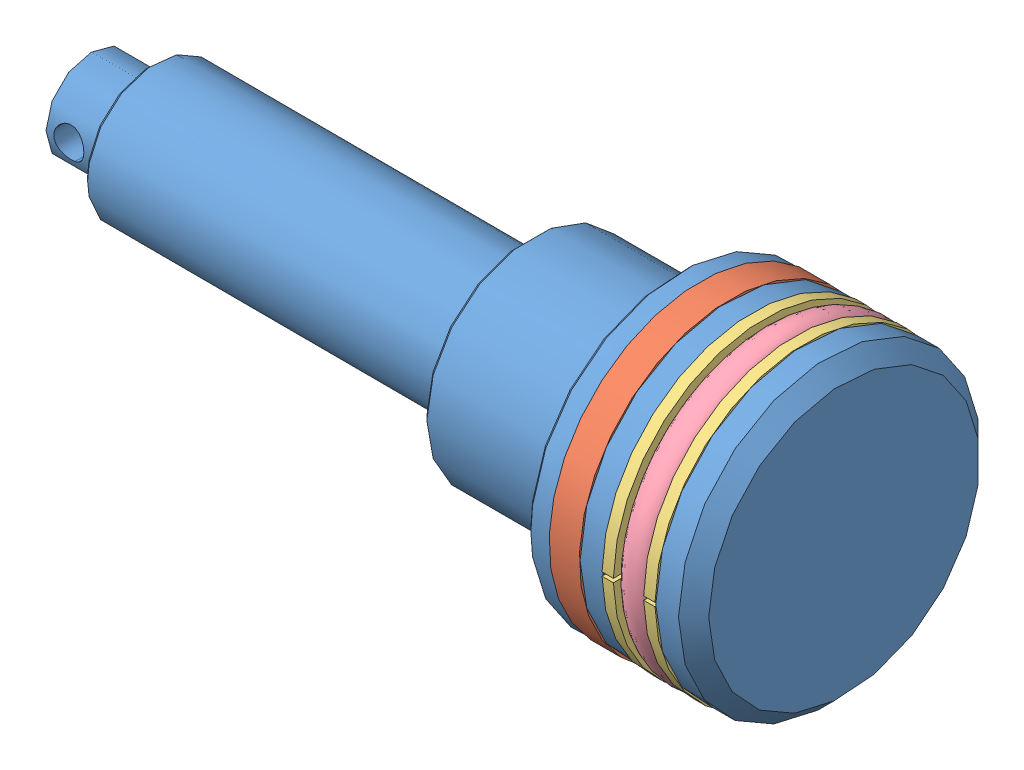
SolidWorks assembly piston.SLDASM, configuration Défaut (file format 4400). Lengths in mm.
Overall size (102 40 40).
12 component instances, 8 part files, 13 mates.
Components (placement in the parent):
- piston-1: piston.SLDPRT [Default] at origin size (102 39.8 39.8)
- racleur 40-1: racleur 40.SLDPRT [Default] at (-19 0 0) x (1 0 0) z (0 -1 0) size (4 40 40)
- bague anti-extrusion 34-40-1: bague anti-extrusion 34-40.SLDPRT [Default] at (-12 0 0) x (0 1 0) z (1 0 0) size (40 40 1.5)
- bague anti-extrusion 34-40-2: bague anti-extrusion 34-40.SLDPRT [Default] at (-5 0 0) x (0 -1 0) z (-1 0 0) size (40 40 1.5)
- joint torique 35.6x3.6-1: joint torique 35.6x3.6.SLDPRT [Default] at (-8.5 0 0) size (4 40 40)
- piston amovible-3: piston amovible.SLDASM [ecorche] at (-59.66 0 0) x (1 0 0) z (0 0.016464 -0.999864) size (18 40 40) (hidden)
  - piston amovible-1: piston amovible.SLDPRT [Default] at origin size (18 39.8 39.8)
  - joint torique 35.6x3.6-1: joint torique 35.6x3.6.SLDPRT [Default] at (13 0 0) size (4 40 40)
  - bague anti-extrusion 34-40-1: bague anti-extrusion 34-40.SLDPRT [Default] at (9.5 0 0) x (0 0 -1) z (1 0 0) size (40 40 1.5)
  - joint torique 16.9x2.7-1: joint torique 16.9x2.7.SLDPRT [Default] at (13.5 0 0) size (3 22 22)
  - bague anti-extrusion 18-21-1: bague anti-extrusion 18-21.SLDPRT [Default] at (10.5 0 0) x (0 0 -1) z (1 0 0) size (22 22 1.5)
  - racleur 18-1: racleur 18.SLDPRT [Default] at (4 0 0) size (4 21 21)
Mates (geometry in assembly coordinates):
- Coïncidente1: coincident aligned: axis of piston-1 through (0 0 0) axis (1 0 0); axis of racleur 40-1 through (-19 0 0) axis (1 0 0)
- Coïncidente2: coincident anti-aligned: plane of piston-1 through (-15 19.9 0) normal (-1 0 0); plane of racleur 40-1 through (-15 0 18.5) normal (1 0 0)
- Angle1: planar angle = 1.570796 rad aligned: plane of racleur 40-1; plane of assembly
- Coïncidente4: coincident anti-aligned: axis of piston-1 through (0 0 0) axis (1 0 0); axis of bague anti-extrusion 34-40-1 through (-10.5 0 0) axis (-1 0 0)
- Coïncidente5: coincident anti-aligned: plane of piston-1 through (-12 17 0) normal (1 0 0); plane of bague anti-extrusion 34-40-1 through (-12 0 0) normal (-1 0 0)
- Angle2: planar angle aligned: plane of bague anti-extrusion 34-40-1; plane of assembly
- Coïncidente9: coincident aligned: axis of piston-1 through (0 0 0) axis (1 0 0); axis of bague anti-extrusion 34-40-2 through (-6.5 0 0) axis (1 0 0)
- Coïncidente10: coincident anti-aligned: plane of piston-1 through (-5 19.9 0) normal (-1 0 0); plane of bague anti-extrusion 34-40-2
- Coïncidente11: coincident anti-aligned: plane of bague anti-extrusion 34-40-2; plane of assembly
- Coïncidente12: coincident aligned: axis of piston-1 through (0 0 0) axis (1 0 0); axis of joint torique 35.6x3.6-1 through (-8.5 0 0) axis (1 0 0)
- Tangent1: tangent: plane of bague anti-extrusion 34-40-2 through (-6.5 0 0) normal (-1 0 0); face of joint torique 35.6x3.6-1
- Coïncidente15: coincident aligned: axis of piston-1 through (0 0 0) axis (1 0 0); axis of piston amovible-3/joint torique 16.9x2.7-1 through (-46.16 0 0) axis (1 0 0)
- Coïncidente16: coincident anti-aligned: plane of piston-1 through (-41.66 13.5 0) normal (-1 0 0); plane of piston amovible-3/piston amovible-1 through (-41.66 -19.3974 -0.3194) normal (1 0 0); sketch_entity of piston-1; plane of piston-1 through (0 0 0) normal (1 0 0); plane of piston-1 through (0 0 0) normal (1 0 0); plane of piston-1 through (0 0 0) normal (1 0 0)
